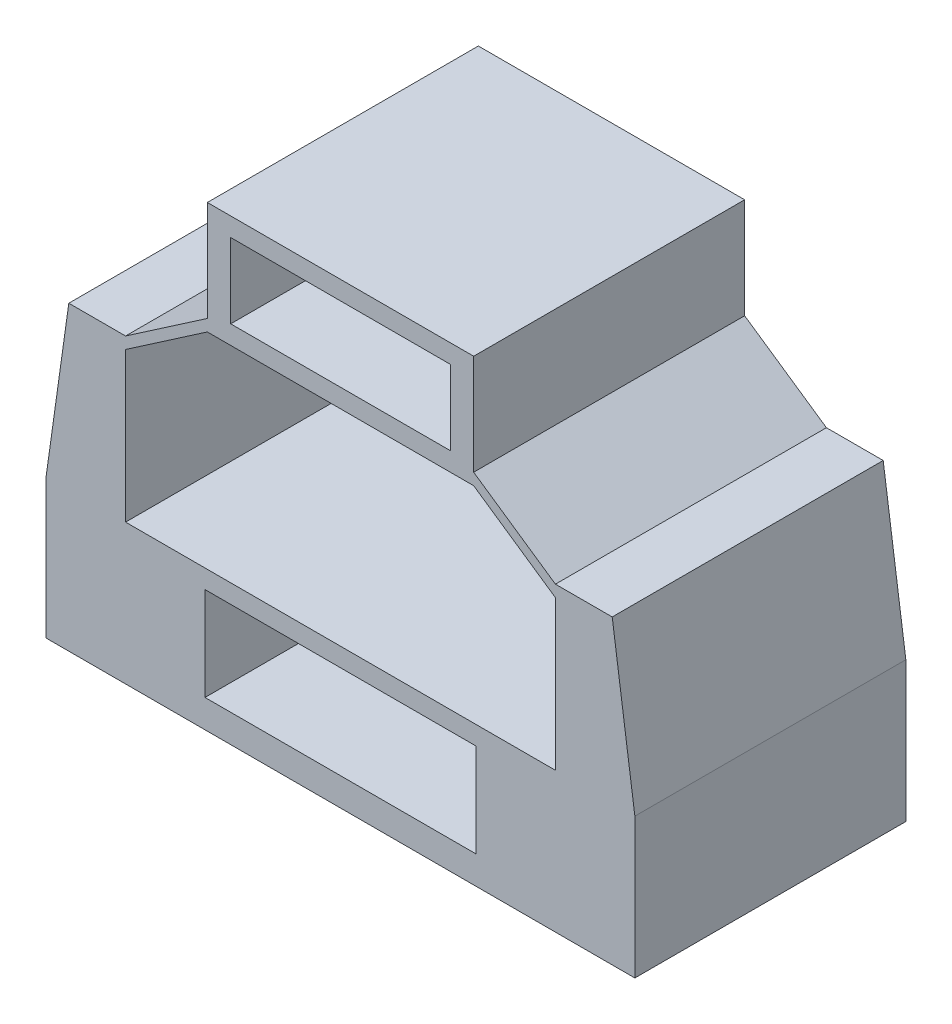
ISO-10303-21;
HEADER;
FILE_DESCRIPTION(('STEP AP214'),'2;1');
FILE_NAME('part.step','',(''),(''),'','','');
FILE_SCHEMA(('AUTOMOTIVE_DESIGN { 1 0 10303 214 1 1 1 1 }'));
ENDSEC;
DATA;
#1=APPLICATION_CONTEXT('core data for automotive mechanical design processes');
#2=APPLICATION_PROTOCOL_DEFINITION('international standard','automotive_design',2000,#1);
#3=PRODUCT_CONTEXT('',#1,'mechanical');
#4=PRODUCT('Part','Part','',(#3));
#5=PRODUCT_RELATED_PRODUCT_CATEGORY('part','',(#4));
#6=PRODUCT_DEFINITION_FORMATION('','',#4);
#7=PRODUCT_DEFINITION_CONTEXT('part definition',#1,'design');
#8=PRODUCT_DEFINITION('design','',#6,#7);
#9=PRODUCT_DEFINITION_SHAPE('','',#8);
#10=(LENGTH_UNIT() NAMED_UNIT(*) SI_UNIT(.MILLI.,.METRE.));
#11=(NAMED_UNIT(*) PLANE_ANGLE_UNIT() SI_UNIT($,.RADIAN.));
#12=(NAMED_UNIT(*) SI_UNIT($,.STERADIAN.) SOLID_ANGLE_UNIT());
#13=UNCERTAINTY_MEASURE_WITH_UNIT(LENGTH_MEASURE(1.E-05),#10,'distance_accuracy_value','');
#14=(GEOMETRIC_REPRESENTATION_CONTEXT(3) GLOBAL_UNCERTAINTY_ASSIGNED_CONTEXT((#13)) GLOBAL_UNIT_ASSIGNED_CONTEXT((#10,
#11,#12)) REPRESENTATION_CONTEXT('',''));
#15=CARTESIAN_POINT('',(0.,0.,0.));
#16=DIRECTION('',(0.,0.,1.));
#17=DIRECTION('',(1.,0.,0.));
#18=AXIS2_PLACEMENT_3D('',#15,#16,#17);
#19=CARTESIAN_POINT('',(0.,0.,5.8));
#20=DIRECTION('',(0.,0.,1.));
#21=DIRECTION('',(1.,0.,0.));
#22=AXIS2_PLACEMENT_3D('',#19,#20,#21);
#23=PLANE('',#22);
#24=DIRECTION('',(0.,1.,0.));
#25=VECTOR('',#24,1.);
#26=CARTESIAN_POINT('',(2.85,9.8,5.8));
#27=LINE('',#26,#25);
#28=CARTESIAN_POINT('',(2.85,7.65,5.8));
#29=VERTEX_POINT('',#28);
#30=CARTESIAN_POINT('',(2.85,9.8,5.8));
#31=VERTEX_POINT('',#30);
#32=EDGE_CURVE('E317',#29,#31,#27,.T.);
#33=ORIENTED_EDGE('',*,*,#32,.T.);
#34=DIRECTION('',(-1.,0.,0.));
#35=VECTOR('',#34,1.);
#36=CARTESIAN_POINT('',(2.85,9.8,5.8));
#37=LINE('',#36,#35);
#38=CARTESIAN_POINT('',(-2.85,9.8,5.8));
#39=VERTEX_POINT('',#38);
#40=EDGE_CURVE('E320',#31,#39,#37,.T.);
#41=ORIENTED_EDGE('',*,*,#40,.T.);
#42=DIRECTION('',(0.,-1.,0.));
#43=VECTOR('',#42,1.);
#44=CARTESIAN_POINT('',(-2.85,9.8,5.8));
#45=LINE('',#44,#43);
#46=CARTESIAN_POINT('',(-2.85,7.65,5.8));
#47=VERTEX_POINT('',#46);
#48=EDGE_CURVE('E323',#39,#47,#45,.T.);
#49=ORIENTED_EDGE('',*,*,#48,.T.);
#50=DIRECTION('',(-0.824728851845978,-0.565528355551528,0.));
#51=VECTOR('',#50,1.);
#52=CARTESIAN_POINT('',(-2.85,7.65,5.8));
#53=LINE('',#52,#51);
#54=CARTESIAN_POINT('',(-4.6,6.45,5.8));
#55=VERTEX_POINT('',#54);
#56=EDGE_CURVE('E325',#47,#55,#53,.T.);
#57=ORIENTED_EDGE('',*,*,#56,.T.);
#58=DIRECTION('',(-1.,0.,0.));
#59=VECTOR('',#58,1.);
#60=CARTESIAN_POINT('',(-4.6,6.45,5.8));
#61=LINE('',#60,#59);
#62=CARTESIAN_POINT('',(-5.8151341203,6.45,5.8));
#63=VERTEX_POINT('',#62);
#64=EDGE_CURVE('E327',#55,#63,#61,.T.);
#65=ORIENTED_EDGE('',*,*,#64,.T.);
#66=DIRECTION('',(-0.139173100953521,-0.99026806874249,0.));
#67=VECTOR('',#66,1.);
#68=CARTESIAN_POINT('',(-5.8151341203,6.45,5.8));
#69=LINE('',#68,#67);
#70=CARTESIAN_POINT('',(-6.3,3.,5.8));
#71=VERTEX_POINT('',#70);
#72=EDGE_CURVE('E329',#63,#71,#69,.T.);
#73=ORIENTED_EDGE('',*,*,#72,.T.);
#74=DIRECTION('',(0.,-1.,0.));
#75=VECTOR('',#74,1.);
#76=CARTESIAN_POINT('',(-6.3,3.,5.8));
#77=LINE('',#76,#75);
#78=CARTESIAN_POINT('',(-6.3,0.,5.8));
#79=VERTEX_POINT('',#78);
#80=EDGE_CURVE('E331',#71,#79,#77,.T.);
#81=ORIENTED_EDGE('',*,*,#80,.T.);
#82=DIRECTION('',(1.,0.,0.));
#83=VECTOR('',#82,1.);
#84=CARTESIAN_POINT('',(-6.3,0.,5.8));
#85=LINE('',#84,#83);
#86=CARTESIAN_POINT('',(6.3,0.,5.8));
#87=VERTEX_POINT('',#86);
#88=EDGE_CURVE('E333',#79,#87,#85,.T.);
#89=ORIENTED_EDGE('',*,*,#88,.T.);
#90=DIRECTION('',(0.,1.,0.));
#91=VECTOR('',#90,1.);
#92=CARTESIAN_POINT('',(6.3,3.,5.8));
#93=LINE('',#92,#91);
#94=CARTESIAN_POINT('',(6.3,3.,5.8));
#95=VERTEX_POINT('',#94);
#96=EDGE_CURVE('E335',#87,#95,#93,.T.);
#97=ORIENTED_EDGE('',*,*,#96,.T.);
#98=DIRECTION('',(-0.139173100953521,0.99026806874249,0.));
#99=VECTOR('',#98,1.);
#100=CARTESIAN_POINT('',(5.8151341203,6.45,5.8));
#101=LINE('',#100,#99);
#102=CARTESIAN_POINT('',(5.8151341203,6.45,5.8));
#103=VERTEX_POINT('',#102);
#104=EDGE_CURVE('E337',#95,#103,#101,.T.);
#105=ORIENTED_EDGE('',*,*,#104,.T.);
#106=DIRECTION('',(-1.,0.,0.));
#107=VECTOR('',#106,1.);
#108=CARTESIAN_POINT('',(4.6,6.45,5.8));
#109=LINE('',#108,#107);
#110=CARTESIAN_POINT('',(4.6,6.45,5.8));
#111=VERTEX_POINT('',#110);
#112=EDGE_CURVE('E339',#103,#111,#109,.T.);
#113=ORIENTED_EDGE('',*,*,#112,.T.);
#114=DIRECTION('',(-0.824728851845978,0.565528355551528,0.));
#115=VECTOR('',#114,1.);
#116=CARTESIAN_POINT('',(2.85,7.65,5.8));
#117=LINE('',#116,#115);
#118=EDGE_CURVE('E341',#111,#29,#117,.T.);
#119=ORIENTED_EDGE('',*,*,#118,.T.);
#120=EDGE_LOOP('',(#33,#41,#49,#57,#65,#73,#81,#89,#97,#105,#113,#119));
#121=FACE_BOUND('',#120,.T.);
#122=DIRECTION('',(0.,1.,0.));
#123=VECTOR('',#122,1.);
#124=CARTESIAN_POINT('',(2.9,0.6,5.8));
#125=LINE('',#124,#123);
#126=CARTESIAN_POINT('',(2.9,0.6,5.8));
#127=VERTEX_POINT('',#126);
#128=CARTESIAN_POINT('',(2.9,2.6,5.8));
#129=VERTEX_POINT('',#128);
#130=EDGE_CURVE('E288',#127,#129,#125,.T.);
#131=ORIENTED_EDGE('',*,*,#130,.F.);
#132=DIRECTION('',(1.,0.,0.));
#133=VECTOR('',#132,1.);
#134=CARTESIAN_POINT('',(2.9,0.6,5.8));
#135=LINE('',#134,#133);
#136=CARTESIAN_POINT('',(-2.9,0.6,5.8));
#137=VERTEX_POINT('',#136);
#138=EDGE_CURVE('E286',#137,#127,#135,.T.);
#139=ORIENTED_EDGE('',*,*,#138,.F.);
#140=DIRECTION('',(0.,-1.,0.));
#141=VECTOR('',#140,1.);
#142=CARTESIAN_POINT('',(-2.9,0.6,5.8));
#143=LINE('',#142,#141);
#144=CARTESIAN_POINT('',(-2.9,2.6,5.8));
#145=VERTEX_POINT('',#144);
#146=EDGE_CURVE('E294',#145,#137,#143,.T.);
#147=ORIENTED_EDGE('',*,*,#146,.F.);
#148=DIRECTION('',(-1.,0.,0.));
#149=VECTOR('',#148,1.);
#150=CARTESIAN_POINT('',(-2.9,2.6,5.8));
#151=LINE('',#150,#149);
#152=EDGE_CURVE('E291',#129,#145,#151,.T.);
#153=ORIENTED_EDGE('',*,*,#152,.F.);
#154=EDGE_LOOP('',(#131,#139,#147,#153));
#155=FACE_BOUND('',#154,.T.);
#156=DIRECTION('',(-0.824728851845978,0.565528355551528,0.));
#157=VECTOR('',#156,1.);
#158=CARTESIAN_POINT('',(4.6,6.2,5.8));
#159=LINE('',#158,#157);
#160=CARTESIAN_POINT('',(4.6,6.2,5.8));
#161=VERTEX_POINT('',#160);
#162=CARTESIAN_POINT('',(2.85,7.4,5.8));
#163=VERTEX_POINT('',#162);
#164=EDGE_CURVE('E243',#161,#163,#159,.T.);
#165=ORIENTED_EDGE('',*,*,#164,.F.);
#166=DIRECTION('',(0.,1.,0.));
#167=VECTOR('',#166,1.);
#168=CARTESIAN_POINT('',(4.6,3.,5.8));
#169=LINE('',#168,#167);
#170=CARTESIAN_POINT('',(4.6,3.,5.8));
#171=VERTEX_POINT('',#170);
#172=EDGE_CURVE('E241',#171,#161,#169,.T.);
#173=ORIENTED_EDGE('',*,*,#172,.F.);
#174=DIRECTION('',(1.,0.,0.));
#175=VECTOR('',#174,1.);
#176=CARTESIAN_POINT('',(4.6,3.,5.8));
#177=LINE('',#176,#175);
#178=CARTESIAN_POINT('',(-4.6,3.,5.8));
#179=VERTEX_POINT('',#178);
#180=EDGE_CURVE('E253',#179,#171,#177,.T.);
#181=ORIENTED_EDGE('',*,*,#180,.F.);
#182=DIRECTION('',(0.,-1.,0.));
#183=VECTOR('',#182,1.);
#184=CARTESIAN_POINT('',(-4.6,3.,5.8));
#185=LINE('',#184,#183);
#186=CARTESIAN_POINT('',(-4.6,6.2,5.8));
#187=VERTEX_POINT('',#186);
#188=EDGE_CURVE('E250',#187,#179,#185,.T.);
#189=ORIENTED_EDGE('',*,*,#188,.F.);
#190=DIRECTION('',(-0.824728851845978,-0.565528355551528,0.));
#191=VECTOR('',#190,1.);
#192=CARTESIAN_POINT('',(-4.6,6.2,5.8));
#193=LINE('',#192,#191);
#194=CARTESIAN_POINT('',(-2.85,7.4,5.8));
#195=VERTEX_POINT('',#194);
#196=EDGE_CURVE('E248',#195,#187,#193,.T.);
#197=ORIENTED_EDGE('',*,*,#196,.F.);
#198=DIRECTION('',(-1.,0.,0.));
#199=VECTOR('',#198,1.);
#200=CARTESIAN_POINT('',(-2.85,7.4,5.8));
#201=LINE('',#200,#199);
#202=EDGE_CURVE('E246',#163,#195,#201,.T.);
#203=ORIENTED_EDGE('',*,*,#202,.F.);
#204=EDGE_LOOP('',(#165,#173,#181,#189,#197,#203));
#205=FACE_BOUND('',#204,.T.);
#206=DIRECTION('',(0.,1.,0.));
#207=VECTOR('',#206,1.);
#208=CARTESIAN_POINT('',(2.35,7.8,5.8));
#209=LINE('',#208,#207);
#210=CARTESIAN_POINT('',(2.35,7.8,5.8));
#211=VERTEX_POINT('',#210);
#212=CARTESIAN_POINT('',(2.35,9.4,5.8));
#213=VERTEX_POINT('',#212);
#214=EDGE_CURVE('E213',#211,#213,#209,.T.);
#215=ORIENTED_EDGE('',*,*,#214,.F.);
#216=DIRECTION('',(1.,0.,0.));
#217=VECTOR('',#216,1.);
#218=CARTESIAN_POINT('',(2.35,7.8,5.8));
#219=LINE('',#218,#217);
#220=CARTESIAN_POINT('',(-2.35,7.8,5.8));
#221=VERTEX_POINT('',#220);
#222=EDGE_CURVE('E205',#221,#211,#219,.T.);
#223=ORIENTED_EDGE('',*,*,#222,.F.);
#224=DIRECTION('',(0.,-1.,0.));
#225=VECTOR('',#224,1.);
#226=CARTESIAN_POINT('',(-2.35,7.8,5.8));
#227=LINE('',#226,#225);
#228=CARTESIAN_POINT('',(-2.35,9.4,5.8));
#229=VERTEX_POINT('',#228);
#230=EDGE_CURVE('E227',#229,#221,#227,.T.);
#231=ORIENTED_EDGE('',*,*,#230,.F.);
#232=DIRECTION('',(-1.,0.,0.));
#233=VECTOR('',#232,1.);
#234=CARTESIAN_POINT('',(-2.35,9.4,5.8));
#235=LINE('',#234,#233);
#236=EDGE_CURVE('E225',#213,#229,#235,.T.);
#237=ORIENTED_EDGE('',*,*,#236,.F.);
#238=EDGE_LOOP('',(#215,#223,#231,#237));
#239=FACE_BOUND('',#238,.T.);
#240=ADVANCED_FACE('F32',(#121,#155,#205,#239),#23,.T.);
#241=CARTESIAN_POINT('',(0.,0.,0.));
#242=DIRECTION('',(0.,0.,1.));
#243=DIRECTION('',(1.,0.,0.));
#244=AXIS2_PLACEMENT_3D('',#241,#242,#243);
#245=PLANE('',#244);
#246=DIRECTION('',(0.,1.,0.));
#247=VECTOR('',#246,1.);
#248=CARTESIAN_POINT('',(4.6,3.,0.));
#249=LINE('',#248,#247);
#250=CARTESIAN_POINT('',(4.6,3.,0.));
#251=VERTEX_POINT('',#250);
#252=CARTESIAN_POINT('',(4.6,6.2,0.));
#253=VERTEX_POINT('',#252);
#254=EDGE_CURVE('E221',#251,#253,#249,.T.);
#255=ORIENTED_EDGE('',*,*,#254,.T.);
#256=DIRECTION('',(-0.824728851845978,0.565528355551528,0.));
#257=VECTOR('',#256,1.);
#258=CARTESIAN_POINT('',(4.6,6.2,0.));
#259=LINE('',#258,#257);
#260=CARTESIAN_POINT('',(2.85,7.4,0.));
#261=VERTEX_POINT('',#260);
#262=EDGE_CURVE('E258',#253,#261,#259,.T.);
#263=ORIENTED_EDGE('',*,*,#262,.T.);
#264=DIRECTION('',(-1.,0.,0.));
#265=VECTOR('',#264,1.);
#266=CARTESIAN_POINT('',(-2.85,7.4,0.));
#267=LINE('',#266,#265);
#268=CARTESIAN_POINT('',(-2.85,7.4,0.));
#269=VERTEX_POINT('',#268);
#270=EDGE_CURVE('E261',#261,#269,#267,.T.);
#271=ORIENTED_EDGE('',*,*,#270,.T.);
#272=DIRECTION('',(-0.824728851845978,-0.565528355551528,0.));
#273=VECTOR('',#272,1.);
#274=CARTESIAN_POINT('',(-4.6,6.2,0.));
#275=LINE('',#274,#273);
#276=CARTESIAN_POINT('',(-4.6,6.2,0.));
#277=VERTEX_POINT('',#276);
#278=EDGE_CURVE('E264',#269,#277,#275,.T.);
#279=ORIENTED_EDGE('',*,*,#278,.T.);
#280=DIRECTION('',(0.,-1.,0.));
#281=VECTOR('',#280,1.);
#282=CARTESIAN_POINT('',(-4.6,3.,0.));
#283=LINE('',#282,#281);
#284=CARTESIAN_POINT('',(-4.6,3.,0.));
#285=VERTEX_POINT('',#284);
#286=EDGE_CURVE('E267',#277,#285,#283,.T.);
#287=ORIENTED_EDGE('',*,*,#286,.T.);
#288=DIRECTION('',(1.,0.,0.));
#289=VECTOR('',#288,1.);
#290=CARTESIAN_POINT('',(4.6,3.,0.));
#291=LINE('',#290,#289);
#292=EDGE_CURVE('E244',#285,#251,#291,.T.);
#293=ORIENTED_EDGE('',*,*,#292,.T.);
#294=EDGE_LOOP('',(#255,#263,#271,#279,#287,#293));
#295=FACE_BOUND('',#294,.T.);
#296=DIRECTION('',(0.,1.,0.));
#297=VECTOR('',#296,1.);
#298=CARTESIAN_POINT('',(2.85,9.8,0.));
#299=LINE('',#298,#297);
#300=CARTESIAN_POINT('',(2.85,7.65,0.));
#301=VERTEX_POINT('',#300);
#302=CARTESIAN_POINT('',(2.85,9.8,0.));
#303=VERTEX_POINT('',#302);
#304=EDGE_CURVE('E316',#301,#303,#299,.T.);
#305=ORIENTED_EDGE('',*,*,#304,.F.);
#306=DIRECTION('',(-0.824728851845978,0.565528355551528,0.));
#307=VECTOR('',#306,1.);
#308=CARTESIAN_POINT('',(2.85,7.65,0.));
#309=LINE('',#308,#307);
#310=CARTESIAN_POINT('',(4.6,6.45,0.));
#311=VERTEX_POINT('',#310);
#312=EDGE_CURVE('E321',#311,#301,#309,.T.);
#313=ORIENTED_EDGE('',*,*,#312,.F.);
#314=DIRECTION('',(-1.,0.,0.));
#315=VECTOR('',#314,1.);
#316=CARTESIAN_POINT('',(4.6,6.45,0.));
#317=LINE('',#316,#315);
#318=CARTESIAN_POINT('',(5.8151341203,6.45,0.));
#319=VERTEX_POINT('',#318);
#320=EDGE_CURVE('E364',#319,#311,#317,.T.);
#321=ORIENTED_EDGE('',*,*,#320,.F.);
#322=DIRECTION('',(-0.139173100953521,0.99026806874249,0.));
#323=VECTOR('',#322,1.);
#324=CARTESIAN_POINT('',(5.8151341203,6.45,0.));
#325=LINE('',#324,#323);
#326=CARTESIAN_POINT('',(6.3,3.,0.));
#327=VERTEX_POINT('',#326);
#328=EDGE_CURVE('E362',#327,#319,#325,.T.);
#329=ORIENTED_EDGE('',*,*,#328,.F.);
#330=DIRECTION('',(0.,1.,0.));
#331=VECTOR('',#330,1.);
#332=CARTESIAN_POINT('',(6.3,3.,0.));
#333=LINE('',#332,#331);
#334=CARTESIAN_POINT('',(6.3,0.,0.));
#335=VERTEX_POINT('',#334);
#336=EDGE_CURVE('E360',#335,#327,#333,.T.);
#337=ORIENTED_EDGE('',*,*,#336,.F.);
#338=DIRECTION('',(1.,0.,0.));
#339=VECTOR('',#338,1.);
#340=CARTESIAN_POINT('',(-6.3,0.,0.));
#341=LINE('',#340,#339);
#342=CARTESIAN_POINT('',(-6.3,0.,0.));
#343=VERTEX_POINT('',#342);
#344=EDGE_CURVE('E358',#343,#335,#341,.T.);
#345=ORIENTED_EDGE('',*,*,#344,.F.);
#346=DIRECTION('',(0.,-1.,0.));
#347=VECTOR('',#346,1.);
#348=CARTESIAN_POINT('',(-6.3,3.,0.));
#349=LINE('',#348,#347);
#350=CARTESIAN_POINT('',(-6.3,3.,0.));
#351=VERTEX_POINT('',#350);
#352=EDGE_CURVE('E356',#351,#343,#349,.T.);
#353=ORIENTED_EDGE('',*,*,#352,.F.);
#354=DIRECTION('',(-0.139173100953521,-0.99026806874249,0.));
#355=VECTOR('',#354,1.);
#356=CARTESIAN_POINT('',(-5.8151341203,6.45,0.));
#357=LINE('',#356,#355);
#358=CARTESIAN_POINT('',(-5.8151341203,6.45,0.));
#359=VERTEX_POINT('',#358);
#360=EDGE_CURVE('E354',#359,#351,#357,.T.);
#361=ORIENTED_EDGE('',*,*,#360,.F.);
#362=DIRECTION('',(-1.,0.,0.));
#363=VECTOR('',#362,1.);
#364=CARTESIAN_POINT('',(-4.6,6.45,0.));
#365=LINE('',#364,#363);
#366=CARTESIAN_POINT('',(-4.6,6.45,0.));
#367=VERTEX_POINT('',#366);
#368=EDGE_CURVE('E352',#367,#359,#365,.T.);
#369=ORIENTED_EDGE('',*,*,#368,.F.);
#370=DIRECTION('',(-0.824728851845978,-0.565528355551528,0.));
#371=VECTOR('',#370,1.);
#372=CARTESIAN_POINT('',(-2.85,7.65,0.));
#373=LINE('',#372,#371);
#374=CARTESIAN_POINT('',(-2.85,7.65,0.));
#375=VERTEX_POINT('',#374);
#376=EDGE_CURVE('E350',#375,#367,#373,.T.);
#377=ORIENTED_EDGE('',*,*,#376,.F.);
#378=DIRECTION('',(0.,-1.,0.));
#379=VECTOR('',#378,1.);
#380=CARTESIAN_POINT('',(-2.85,9.8,0.));
#381=LINE('',#380,#379);
#382=CARTESIAN_POINT('',(-2.85,9.8,0.));
#383=VERTEX_POINT('',#382);
#384=EDGE_CURVE('E348',#383,#375,#381,.T.);
#385=ORIENTED_EDGE('',*,*,#384,.F.);
#386=DIRECTION('',(-1.,0.,0.));
#387=VECTOR('',#386,1.);
#388=CARTESIAN_POINT('',(2.85,9.8,0.));
#389=LINE('',#388,#387);
#390=EDGE_CURVE('E346',#303,#383,#389,.T.);
#391=ORIENTED_EDGE('',*,*,#390,.F.);
#392=EDGE_LOOP('',(#305,#313,#321,#329,#337,#345,#353,#361,#369,#377,#385,#391));
#393=FACE_BOUND('',#392,.T.);
#394=DIRECTION('',(1.,0.,0.));
#395=VECTOR('',#394,1.);
#396=CARTESIAN_POINT('',(2.9,0.6,0.));
#397=LINE('',#396,#395);
#398=CARTESIAN_POINT('',(-2.9,0.6,0.));
#399=VERTEX_POINT('',#398);
#400=CARTESIAN_POINT('',(2.9,0.6,0.));
#401=VERTEX_POINT('',#400);
#402=EDGE_CURVE('E285',#399,#401,#397,.T.);
#403=ORIENTED_EDGE('',*,*,#402,.T.);
#404=DIRECTION('',(0.,1.,0.));
#405=VECTOR('',#404,1.);
#406=CARTESIAN_POINT('',(2.9,0.6,0.));
#407=LINE('',#406,#405);
#408=CARTESIAN_POINT('',(2.9,2.6,0.));
#409=VERTEX_POINT('',#408);
#410=EDGE_CURVE('E299',#401,#409,#407,.T.);
#411=ORIENTED_EDGE('',*,*,#410,.T.);
#412=DIRECTION('',(-1.,0.,0.));
#413=VECTOR('',#412,1.);
#414=CARTESIAN_POINT('',(-2.9,2.6,0.));
#415=LINE('',#414,#413);
#416=CARTESIAN_POINT('',(-2.9,2.6,0.));
#417=VERTEX_POINT('',#416);
#418=EDGE_CURVE('E302',#409,#417,#415,.T.);
#419=ORIENTED_EDGE('',*,*,#418,.T.);
#420=DIRECTION('',(0.,-1.,0.));
#421=VECTOR('',#420,1.);
#422=CARTESIAN_POINT('',(-2.9,0.6,0.));
#423=LINE('',#422,#421);
#424=EDGE_CURVE('E289',#417,#399,#423,.T.);
#425=ORIENTED_EDGE('',*,*,#424,.T.);
#426=EDGE_LOOP('',(#403,#411,#419,#425));
#427=FACE_BOUND('',#426,.T.);
#428=DIRECTION('',(1.,0.,0.));
#429=VECTOR('',#428,1.);
#430=CARTESIAN_POINT('',(2.35,7.8,0.));
#431=LINE('',#430,#429);
#432=CARTESIAN_POINT('',(-2.35,7.8,0.));
#433=VERTEX_POINT('',#432);
#434=CARTESIAN_POINT('',(2.35,7.8,0.));
#435=VERTEX_POINT('',#434);
#436=EDGE_CURVE('E55',#433,#435,#431,.T.);
#437=ORIENTED_EDGE('',*,*,#436,.T.);
#438=DIRECTION('',(0.,1.,0.));
#439=VECTOR('',#438,1.);
#440=CARTESIAN_POINT('',(2.35,7.8,0.));
#441=LINE('',#440,#439);
#442=CARTESIAN_POINT('',(2.35,9.4,0.));
#443=VERTEX_POINT('',#442);
#444=EDGE_CURVE('E220',#435,#443,#441,.T.);
#445=ORIENTED_EDGE('',*,*,#444,.T.);
#446=DIRECTION('',(-1.,0.,0.));
#447=VECTOR('',#446,1.);
#448=CARTESIAN_POINT('',(-2.35,9.4,0.));
#449=LINE('',#448,#447);
#450=CARTESIAN_POINT('',(-2.35,9.4,0.));
#451=VERTEX_POINT('',#450);
#452=EDGE_CURVE('E233',#443,#451,#449,.T.);
#453=ORIENTED_EDGE('',*,*,#452,.T.);
#454=DIRECTION('',(0.,-1.,0.));
#455=VECTOR('',#454,1.);
#456=CARTESIAN_POINT('',(-2.35,7.8,0.));
#457=LINE('',#456,#455);
#458=EDGE_CURVE('E214',#451,#433,#457,.T.);
#459=ORIENTED_EDGE('',*,*,#458,.T.);
#460=EDGE_LOOP('',(#437,#445,#453,#459));
#461=FACE_BOUND('',#460,.T.);
#462=ADVANCED_FACE('F406',(#295,#393,#427,#461),#245,.F.);
#463=CARTESIAN_POINT('',(2.85,9.8,5.8));
#464=DIRECTION('',(-1.,0.,0.));
#465=DIRECTION('',(0.,0.,1.));
#466=AXIS2_PLACEMENT_3D('',#463,#464,#465);
#467=PLANE('',#466);
#468=ORIENTED_EDGE('',*,*,#304,.T.);
#469=DIRECTION('',(0.,0.,-1.));
#470=VECTOR('',#469,1.);
#471=CARTESIAN_POINT('',(2.85,9.8,5.8));
#472=LINE('',#471,#470);
#473=EDGE_CURVE('E11',#31,#303,#472,.T.);
#474=ORIENTED_EDGE('',*,*,#473,.F.);
#475=ORIENTED_EDGE('',*,*,#32,.F.);
#476=DIRECTION('',(0.,0.,-1.));
#477=VECTOR('',#476,1.);
#478=CARTESIAN_POINT('',(2.85,7.65,5.8));
#479=LINE('',#478,#477);
#480=EDGE_CURVE('E343',#29,#301,#479,.T.);
#481=ORIENTED_EDGE('',*,*,#480,.T.);
#482=EDGE_LOOP('',(#468,#474,#475,#481));
#483=FACE_BOUND('',#482,.T.);
#484=ADVANCED_FACE('F34',(#483),#467,.F.);
#485=CARTESIAN_POINT('',(2.85,9.8,5.8));
#486=DIRECTION('',(0.,-1.,0.));
#487=DIRECTION('',(0.,0.,-1.));
#488=AXIS2_PLACEMENT_3D('',#485,#486,#487);
#489=PLANE('',#488);
#490=ORIENTED_EDGE('',*,*,#390,.T.);
#491=DIRECTION('',(0.,0.,-1.));
#492=VECTOR('',#491,1.);
#493=CARTESIAN_POINT('',(-2.85,9.8,5.8));
#494=LINE('',#493,#492);
#495=EDGE_CURVE('E40',#39,#383,#494,.T.);
#496=ORIENTED_EDGE('',*,*,#495,.F.);
#497=ORIENTED_EDGE('',*,*,#40,.F.);
#498=ORIENTED_EDGE('',*,*,#473,.T.);
#499=EDGE_LOOP('',(#490,#496,#497,#498));
#500=FACE_BOUND('',#499,.T.);
#501=ADVANCED_FACE('F424',(#500),#489,.F.);
#502=CARTESIAN_POINT('',(-2.85,9.8,5.8));
#503=DIRECTION('',(1.,0.,0.));
#504=DIRECTION('',(0.,0.,-1.));
#505=AXIS2_PLACEMENT_3D('',#502,#503,#504);
#506=PLANE('',#505);
#507=ORIENTED_EDGE('',*,*,#384,.T.);
#508=DIRECTION('',(0.,0.,-1.));
#509=VECTOR('',#508,1.);
#510=CARTESIAN_POINT('',(-2.85,7.65,5.8));
#511=LINE('',#510,#509);
#512=EDGE_CURVE('E393',#47,#375,#511,.T.);
#513=ORIENTED_EDGE('',*,*,#512,.F.);
#514=ORIENTED_EDGE('',*,*,#48,.F.);
#515=ORIENTED_EDGE('',*,*,#495,.T.);
#516=EDGE_LOOP('',(#507,#513,#514,#515));
#517=FACE_BOUND('',#516,.T.);
#518=ADVANCED_FACE('F400',(#517),#506,.F.);
#519=CARTESIAN_POINT('',(-2.85,7.65,5.8));
#520=DIRECTION('',(0.565528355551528,-0.824728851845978,0.));
#521=DIRECTION('',(0.824728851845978,0.565528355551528,0.));
#522=AXIS2_PLACEMENT_3D('',#519,#520,#521);
#523=PLANE('',#522);
#524=ORIENTED_EDGE('',*,*,#376,.T.);
#525=DIRECTION('',(0.,0.,-1.));
#526=VECTOR('',#525,1.);
#527=CARTESIAN_POINT('',(-4.6,6.45,5.8));
#528=LINE('',#527,#526);
#529=EDGE_CURVE('E390',#55,#367,#528,.T.);
#530=ORIENTED_EDGE('',*,*,#529,.F.);
#531=ORIENTED_EDGE('',*,*,#56,.F.);
#532=ORIENTED_EDGE('',*,*,#512,.T.);
#533=EDGE_LOOP('',(#524,#530,#531,#532));
#534=FACE_BOUND('',#533,.T.);
#535=ADVANCED_FACE('F412',(#534),#523,.F.);
#536=CARTESIAN_POINT('',(-4.6,6.45,5.8));
#537=DIRECTION('',(0.,-1.,0.));
#538=DIRECTION('',(0.,0.,-1.));
#539=AXIS2_PLACEMENT_3D('',#536,#537,#538);
#540=PLANE('',#539);
#541=ORIENTED_EDGE('',*,*,#368,.T.);
#542=DIRECTION('',(0.,0.,-1.));
#543=VECTOR('',#542,1.);
#544=CARTESIAN_POINT('',(-5.8151341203,6.45,5.8));
#545=LINE('',#544,#543);
#546=EDGE_CURVE('E387',#63,#359,#545,.T.);
#547=ORIENTED_EDGE('',*,*,#546,.F.);
#548=ORIENTED_EDGE('',*,*,#64,.F.);
#549=ORIENTED_EDGE('',*,*,#529,.T.);
#550=EDGE_LOOP('',(#541,#547,#548,#549));
#551=FACE_BOUND('',#550,.T.);
#552=ADVANCED_FACE('F416',(#551),#540,.F.);
#553=CARTESIAN_POINT('',(-5.8151341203,6.45,5.8));
#554=DIRECTION('',(0.99026806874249,-0.139173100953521,0.));
#555=DIRECTION('',(0.139173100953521,0.99026806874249,0.));
#556=AXIS2_PLACEMENT_3D('',#553,#554,#555);
#557=PLANE('',#556);
#558=ORIENTED_EDGE('',*,*,#360,.T.);
#559=DIRECTION('',(0.,0.,-1.));
#560=VECTOR('',#559,1.);
#561=CARTESIAN_POINT('',(-6.3,3.,5.8));
#562=LINE('',#561,#560);
#563=EDGE_CURVE('E384',#71,#351,#562,.T.);
#564=ORIENTED_EDGE('',*,*,#563,.F.);
#565=ORIENTED_EDGE('',*,*,#72,.F.);
#566=ORIENTED_EDGE('',*,*,#546,.T.);
#567=EDGE_LOOP('',(#558,#564,#565,#566));
#568=FACE_BOUND('',#567,.T.);
#569=ADVANCED_FACE('F457',(#568),#557,.F.);
#570=CARTESIAN_POINT('',(-6.3,3.,5.8));
#571=DIRECTION('',(1.,0.,0.));
#572=DIRECTION('',(0.,0.,-1.));
#573=AXIS2_PLACEMENT_3D('',#570,#571,#572);
#574=PLANE('',#573);
#575=ORIENTED_EDGE('',*,*,#352,.T.);
#576=DIRECTION('',(0.,0.,-1.));
#577=VECTOR('',#576,1.);
#578=CARTESIAN_POINT('',(-6.3,0.,5.8));
#579=LINE('',#578,#577);
#580=EDGE_CURVE('E381',#79,#343,#579,.T.);
#581=ORIENTED_EDGE('',*,*,#580,.F.);
#582=ORIENTED_EDGE('',*,*,#80,.F.);
#583=ORIENTED_EDGE('',*,*,#563,.T.);
#584=EDGE_LOOP('',(#575,#581,#582,#583));
#585=FACE_BOUND('',#584,.T.);
#586=ADVANCED_FACE('F455',(#585),#574,.F.);
#587=CARTESIAN_POINT('',(-6.3,0.,5.8));
#588=DIRECTION('',(0.,1.,0.));
#589=DIRECTION('',(0.,0.,1.));
#590=AXIS2_PLACEMENT_3D('',#587,#588,#589);
#591=PLANE('',#590);
#592=ORIENTED_EDGE('',*,*,#344,.T.);
#593=DIRECTION('',(0.,0.,-1.));
#594=VECTOR('',#593,1.);
#595=CARTESIAN_POINT('',(6.3,0.,5.8));
#596=LINE('',#595,#594);
#597=EDGE_CURVE('E378',#87,#335,#596,.T.);
#598=ORIENTED_EDGE('',*,*,#597,.F.);
#599=ORIENTED_EDGE('',*,*,#88,.F.);
#600=ORIENTED_EDGE('',*,*,#580,.T.);
#601=EDGE_LOOP('',(#592,#598,#599,#600));
#602=FACE_BOUND('',#601,.T.);
#603=ADVANCED_FACE('F451',(#602),#591,.F.);
#604=CARTESIAN_POINT('',(6.3,3.,5.8));
#605=DIRECTION('',(-1.,0.,0.));
#606=DIRECTION('',(0.,0.,1.));
#607=AXIS2_PLACEMENT_3D('',#604,#605,#606);
#608=PLANE('',#607);
#609=ORIENTED_EDGE('',*,*,#336,.T.);
#610=DIRECTION('',(0.,0.,-1.));
#611=VECTOR('',#610,1.);
#612=CARTESIAN_POINT('',(6.3,3.,5.8));
#613=LINE('',#612,#611);
#614=EDGE_CURVE('E375',#95,#327,#613,.T.);
#615=ORIENTED_EDGE('',*,*,#614,.F.);
#616=ORIENTED_EDGE('',*,*,#96,.F.);
#617=ORIENTED_EDGE('',*,*,#597,.T.);
#618=EDGE_LOOP('',(#609,#615,#616,#617));
#619=FACE_BOUND('',#618,.T.);
#620=ADVANCED_FACE('F446',(#619),#608,.F.);
#621=CARTESIAN_POINT('',(5.8151341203,6.45,5.8));
#622=DIRECTION('',(-0.99026806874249,-0.139173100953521,0.));
#623=DIRECTION('',(0.139173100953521,-0.99026806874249,0.));
#624=AXIS2_PLACEMENT_3D('',#621,#622,#623);
#625=PLANE('',#624);
#626=ORIENTED_EDGE('',*,*,#328,.T.);
#627=DIRECTION('',(0.,0.,-1.));
#628=VECTOR('',#627,1.);
#629=CARTESIAN_POINT('',(5.8151341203,6.45,5.8));
#630=LINE('',#629,#628);
#631=EDGE_CURVE('E372',#103,#319,#630,.T.);
#632=ORIENTED_EDGE('',*,*,#631,.F.);
#633=ORIENTED_EDGE('',*,*,#104,.F.);
#634=ORIENTED_EDGE('',*,*,#614,.T.);
#635=EDGE_LOOP('',(#626,#632,#633,#634));
#636=FACE_BOUND('',#635,.T.);
#637=ADVANCED_FACE('F440',(#636),#625,.F.);
#638=CARTESIAN_POINT('',(4.6,6.45,5.8));
#639=DIRECTION('',(0.,-1.,0.));
#640=DIRECTION('',(0.,0.,-1.));
#641=AXIS2_PLACEMENT_3D('',#638,#639,#640);
#642=PLANE('',#641);
#643=ORIENTED_EDGE('',*,*,#320,.T.);
#644=DIRECTION('',(0.,0.,-1.));
#645=VECTOR('',#644,1.);
#646=CARTESIAN_POINT('',(4.6,6.45,5.8));
#647=LINE('',#646,#645);
#648=EDGE_CURVE('E369',#111,#311,#647,.T.);
#649=ORIENTED_EDGE('',*,*,#648,.F.);
#650=ORIENTED_EDGE('',*,*,#112,.F.);
#651=ORIENTED_EDGE('',*,*,#631,.T.);
#652=EDGE_LOOP('',(#643,#649,#650,#651));
#653=FACE_BOUND('',#652,.T.);
#654=ADVANCED_FACE('F436',(#653),#642,.F.);
#655=CARTESIAN_POINT('',(2.85,7.65,5.8));
#656=DIRECTION('',(-0.565528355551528,-0.824728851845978,0.));
#657=DIRECTION('',(0.824728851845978,-0.565528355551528,0.));
#658=AXIS2_PLACEMENT_3D('',#655,#656,#657);
#659=PLANE('',#658);
#660=ORIENTED_EDGE('',*,*,#312,.T.);
#661=ORIENTED_EDGE('',*,*,#480,.F.);
#662=ORIENTED_EDGE('',*,*,#118,.F.);
#663=ORIENTED_EDGE('',*,*,#648,.T.);
#664=EDGE_LOOP('',(#660,#661,#662,#663));
#665=FACE_BOUND('',#664,.T.);
#666=ADVANCED_FACE('F431',(#665),#659,.F.);
#667=CARTESIAN_POINT('',(2.9,0.6,5.8));
#668=DIRECTION('',(0.,1.,0.));
#669=DIRECTION('',(0.,0.,1.));
#670=AXIS2_PLACEMENT_3D('',#667,#668,#669);
#671=PLANE('',#670);
#672=ORIENTED_EDGE('',*,*,#402,.F.);
#673=DIRECTION('',(0.,0.,-1.));
#674=VECTOR('',#673,1.);
#675=CARTESIAN_POINT('',(-2.9,0.6,5.8));
#676=LINE('',#675,#674);
#677=EDGE_CURVE('E296',#137,#399,#676,.T.);
#678=ORIENTED_EDGE('',*,*,#677,.F.);
#679=ORIENTED_EDGE('',*,*,#138,.T.);
#680=DIRECTION('',(0.,0.,-1.));
#681=VECTOR('',#680,1.);
#682=CARTESIAN_POINT('',(2.9,0.6,5.8));
#683=LINE('',#682,#681);
#684=EDGE_CURVE('E313',#127,#401,#683,.T.);
#685=ORIENTED_EDGE('',*,*,#684,.T.);
#686=EDGE_LOOP('',(#672,#678,#679,#685));
#687=FACE_BOUND('',#686,.T.);
#688=ADVANCED_FACE('F474',(#687),#671,.T.);
#689=CARTESIAN_POINT('',(2.9,0.6,5.8));
#690=DIRECTION('',(-1.,0.,0.));
#691=DIRECTION('',(0.,0.,1.));
#692=AXIS2_PLACEMENT_3D('',#689,#690,#691);
#693=PLANE('',#692);
#694=ORIENTED_EDGE('',*,*,#410,.F.);
#695=ORIENTED_EDGE('',*,*,#684,.F.);
#696=ORIENTED_EDGE('',*,*,#130,.T.);
#697=DIRECTION('',(0.,0.,-1.));
#698=VECTOR('',#697,1.);
#699=CARTESIAN_POINT('',(2.9,2.6,5.8));
#700=LINE('',#699,#698);
#701=EDGE_CURVE('E311',#129,#409,#700,.T.);
#702=ORIENTED_EDGE('',*,*,#701,.T.);
#703=EDGE_LOOP('',(#694,#695,#696,#702));
#704=FACE_BOUND('',#703,.T.);
#705=ADVANCED_FACE('F512',(#704),#693,.T.);
#706=CARTESIAN_POINT('',(-2.9,2.6,5.8));
#707=DIRECTION('',(0.,-1.,0.));
#708=DIRECTION('',(0.,0.,-1.));
#709=AXIS2_PLACEMENT_3D('',#706,#707,#708);
#710=PLANE('',#709);
#711=ORIENTED_EDGE('',*,*,#418,.F.);
#712=ORIENTED_EDGE('',*,*,#701,.F.);
#713=ORIENTED_EDGE('',*,*,#152,.T.);
#714=DIRECTION('',(0.,0.,-1.));
#715=VECTOR('',#714,1.);
#716=CARTESIAN_POINT('',(-2.9,2.6,5.8));
#717=LINE('',#716,#715);
#718=EDGE_CURVE('E309',#145,#417,#717,.T.);
#719=ORIENTED_EDGE('',*,*,#718,.T.);
#720=EDGE_LOOP('',(#711,#712,#713,#719));
#721=FACE_BOUND('',#720,.T.);
#722=ADVANCED_FACE('F519',(#721),#710,.T.);
#723=CARTESIAN_POINT('',(-2.9,0.6,5.8));
#724=DIRECTION('',(1.,0.,0.));
#725=DIRECTION('',(0.,0.,-1.));
#726=AXIS2_PLACEMENT_3D('',#723,#724,#725);
#727=PLANE('',#726);
#728=ORIENTED_EDGE('',*,*,#424,.F.);
#729=ORIENTED_EDGE('',*,*,#718,.F.);
#730=ORIENTED_EDGE('',*,*,#146,.T.);
#731=ORIENTED_EDGE('',*,*,#677,.T.);
#732=EDGE_LOOP('',(#728,#729,#730,#731));
#733=FACE_BOUND('',#732,.T.);
#734=ADVANCED_FACE('F526',(#733),#727,.T.);
#735=CARTESIAN_POINT('',(4.6,3.,5.8));
#736=DIRECTION('',(-1.,0.,0.));
#737=DIRECTION('',(0.,0.,1.));
#738=AXIS2_PLACEMENT_3D('',#735,#736,#737);
#739=PLANE('',#738);
#740=ORIENTED_EDGE('',*,*,#254,.F.);
#741=DIRECTION('',(0.,0.,-1.));
#742=VECTOR('',#741,1.);
#743=CARTESIAN_POINT('',(4.6,3.,5.8));
#744=LINE('',#743,#742);
#745=EDGE_CURVE('E255',#171,#251,#744,.T.);
#746=ORIENTED_EDGE('',*,*,#745,.F.);
#747=ORIENTED_EDGE('',*,*,#172,.T.);
#748=DIRECTION('',(0.,0.,-1.));
#749=VECTOR('',#748,1.);
#750=CARTESIAN_POINT('',(4.6,6.2,5.8));
#751=LINE('',#750,#749);
#752=EDGE_CURVE('E282',#161,#253,#751,.T.);
#753=ORIENTED_EDGE('',*,*,#752,.T.);
#754=EDGE_LOOP('',(#740,#746,#747,#753));
#755=FACE_BOUND('',#754,.T.);
#756=ADVANCED_FACE('F534',(#755),#739,.T.);
#757=CARTESIAN_POINT('',(4.6,6.2,5.8));
#758=DIRECTION('',(-0.565528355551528,-0.824728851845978,0.));
#759=DIRECTION('',(0.824728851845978,-0.565528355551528,0.));
#760=AXIS2_PLACEMENT_3D('',#757,#758,#759);
#761=PLANE('',#760);
#762=ORIENTED_EDGE('',*,*,#262,.F.);
#763=ORIENTED_EDGE('',*,*,#752,.F.);
#764=ORIENTED_EDGE('',*,*,#164,.T.);
#765=DIRECTION('',(0.,0.,-1.));
#766=VECTOR('',#765,1.);
#767=CARTESIAN_POINT('',(2.85,7.4,5.8));
#768=LINE('',#767,#766);
#769=EDGE_CURVE('E280',#163,#261,#768,.T.);
#770=ORIENTED_EDGE('',*,*,#769,.T.);
#771=EDGE_LOOP('',(#762,#763,#764,#770));
#772=FACE_BOUND('',#771,.T.);
#773=ADVANCED_FACE('F542',(#772),#761,.T.);
#774=CARTESIAN_POINT('',(-2.85,7.4,5.8));
#775=DIRECTION('',(0.,-1.,0.));
#776=DIRECTION('',(0.,0.,-1.));
#777=AXIS2_PLACEMENT_3D('',#774,#775,#776);
#778=PLANE('',#777);
#779=ORIENTED_EDGE('',*,*,#270,.F.);
#780=ORIENTED_EDGE('',*,*,#769,.F.);
#781=ORIENTED_EDGE('',*,*,#202,.T.);
#782=DIRECTION('',(0.,0.,-1.));
#783=VECTOR('',#782,1.);
#784=CARTESIAN_POINT('',(-2.85,7.4,5.8));
#785=LINE('',#784,#783);
#786=EDGE_CURVE('E278',#195,#269,#785,.T.);
#787=ORIENTED_EDGE('',*,*,#786,.T.);
#788=EDGE_LOOP('',(#779,#780,#781,#787));
#789=FACE_BOUND('',#788,.T.);
#790=ADVANCED_FACE('F550',(#789),#778,.T.);
#791=CARTESIAN_POINT('',(-4.6,6.2,5.8));
#792=DIRECTION('',(0.565528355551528,-0.824728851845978,0.));
#793=DIRECTION('',(0.824728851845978,0.565528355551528,0.));
#794=AXIS2_PLACEMENT_3D('',#791,#792,#793);
#795=PLANE('',#794);
#796=ORIENTED_EDGE('',*,*,#278,.F.);
#797=ORIENTED_EDGE('',*,*,#786,.F.);
#798=ORIENTED_EDGE('',*,*,#196,.T.);
#799=DIRECTION('',(0.,0.,-1.));
#800=VECTOR('',#799,1.);
#801=CARTESIAN_POINT('',(-4.6,6.2,5.8));
#802=LINE('',#801,#800);
#803=EDGE_CURVE('E276',#187,#277,#802,.T.);
#804=ORIENTED_EDGE('',*,*,#803,.T.);
#805=EDGE_LOOP('',(#796,#797,#798,#804));
#806=FACE_BOUND('',#805,.T.);
#807=ADVANCED_FACE('F558',(#806),#795,.T.);
#808=CARTESIAN_POINT('',(-4.6,3.,5.8));
#809=DIRECTION('',(1.,0.,0.));
#810=DIRECTION('',(0.,0.,-1.));
#811=AXIS2_PLACEMENT_3D('',#808,#809,#810);
#812=PLANE('',#811);
#813=ORIENTED_EDGE('',*,*,#286,.F.);
#814=ORIENTED_EDGE('',*,*,#803,.F.);
#815=ORIENTED_EDGE('',*,*,#188,.T.);
#816=DIRECTION('',(0.,0.,-1.));
#817=VECTOR('',#816,1.);
#818=CARTESIAN_POINT('',(-4.6,3.,5.8));
#819=LINE('',#818,#817);
#820=EDGE_CURVE('E274',#179,#285,#819,.T.);
#821=ORIENTED_EDGE('',*,*,#820,.T.);
#822=EDGE_LOOP('',(#813,#814,#815,#821));
#823=FACE_BOUND('',#822,.T.);
#824=ADVANCED_FACE('F566',(#823),#812,.T.);
#825=CARTESIAN_POINT('',(4.6,3.,5.8));
#826=DIRECTION('',(0.,1.,0.));
#827=DIRECTION('',(0.,0.,1.));
#828=AXIS2_PLACEMENT_3D('',#825,#826,#827);
#829=PLANE('',#828);
#830=ORIENTED_EDGE('',*,*,#292,.F.);
#831=ORIENTED_EDGE('',*,*,#820,.F.);
#832=ORIENTED_EDGE('',*,*,#180,.T.);
#833=ORIENTED_EDGE('',*,*,#745,.T.);
#834=EDGE_LOOP('',(#830,#831,#832,#833));
#835=FACE_BOUND('',#834,.T.);
#836=ADVANCED_FACE('F574',(#835),#829,.T.);
#837=CARTESIAN_POINT('',(2.35,7.8,5.8));
#838=DIRECTION('',(0.,1.,0.));
#839=DIRECTION('',(0.,0.,1.));
#840=AXIS2_PLACEMENT_3D('',#837,#838,#839);
#841=PLANE('',#840);
#842=ORIENTED_EDGE('',*,*,#436,.F.);
#843=DIRECTION('',(0.,0.,-1.));
#844=VECTOR('',#843,1.);
#845=CARTESIAN_POINT('',(-2.35,7.8,5.8));
#846=LINE('',#845,#844);
#847=EDGE_CURVE('E209',#221,#433,#846,.T.);
#848=ORIENTED_EDGE('',*,*,#847,.F.);
#849=ORIENTED_EDGE('',*,*,#222,.T.);
#850=DIRECTION('',(0.,0.,-1.));
#851=VECTOR('',#850,1.);
#852=CARTESIAN_POINT('',(2.35,7.8,5.8));
#853=LINE('',#852,#851);
#854=EDGE_CURVE('E208',#211,#435,#853,.T.);
#855=ORIENTED_EDGE('',*,*,#854,.T.);
#856=EDGE_LOOP('',(#842,#848,#849,#855));
#857=FACE_BOUND('',#856,.T.);
#858=ADVANCED_FACE('F207',(#857),#841,.T.);
#859=CARTESIAN_POINT('',(2.35,7.8,5.8));
#860=DIRECTION('',(-1.,0.,0.));
#861=DIRECTION('',(0.,0.,1.));
#862=AXIS2_PLACEMENT_3D('',#859,#860,#861);
#863=PLANE('',#862);
#864=ORIENTED_EDGE('',*,*,#444,.F.);
#865=ORIENTED_EDGE('',*,*,#854,.F.);
#866=ORIENTED_EDGE('',*,*,#214,.T.);
#867=DIRECTION('',(0.,0.,-1.));
#868=VECTOR('',#867,1.);
#869=CARTESIAN_POINT('',(2.35,9.4,5.8));
#870=LINE('',#869,#868);
#871=EDGE_CURVE('E222',#213,#443,#870,.T.);
#872=ORIENTED_EDGE('',*,*,#871,.T.);
#873=EDGE_LOOP('',(#864,#865,#866,#872));
#874=FACE_BOUND('',#873,.T.);
#875=ADVANCED_FACE('F217',(#874),#863,.T.);
#876=CARTESIAN_POINT('',(-2.35,9.4,5.8));
#877=DIRECTION('',(0.,-1.,0.));
#878=DIRECTION('',(0.,0.,-1.));
#879=AXIS2_PLACEMENT_3D('',#876,#877,#878);
#880=PLANE('',#879);
#881=ORIENTED_EDGE('',*,*,#452,.F.);
#882=ORIENTED_EDGE('',*,*,#871,.F.);
#883=ORIENTED_EDGE('',*,*,#236,.T.);
#884=DIRECTION('',(0.,0.,-1.));
#885=VECTOR('',#884,1.);
#886=CARTESIAN_POINT('',(-2.35,9.4,5.8));
#887=LINE('',#886,#885);
#888=EDGE_CURVE('E47',#229,#451,#887,.T.);
#889=ORIENTED_EDGE('',*,*,#888,.T.);
#890=EDGE_LOOP('',(#881,#882,#883,#889));
#891=FACE_BOUND('',#890,.T.);
#892=ADVANCED_FACE('F595',(#891),#880,.T.);
#893=CARTESIAN_POINT('',(-2.35,7.8,5.8));
#894=DIRECTION('',(1.,0.,0.));
#895=DIRECTION('',(0.,0.,-1.));
#896=AXIS2_PLACEMENT_3D('',#893,#894,#895);
#897=PLANE('',#896);
#898=ORIENTED_EDGE('',*,*,#458,.F.);
#899=ORIENTED_EDGE('',*,*,#888,.F.);
#900=ORIENTED_EDGE('',*,*,#230,.T.);
#901=ORIENTED_EDGE('',*,*,#847,.T.);
#902=EDGE_LOOP('',(#898,#899,#900,#901));
#903=FACE_BOUND('',#902,.T.);
#904=ADVANCED_FACE('F602',(#903),#897,.T.);
#905=CLOSED_SHELL('',(#240,#462,#484,#501,#518,#535,#552,#569,#586,#603,#620,#637,#654,#666,
#688,#705,#722,#734,#756,#773,#790,#807,#824,#836,#858,#875,#892,#904));
#906=MANIFOLD_SOLID_BREP('B2',#905);
#907=ADVANCED_BREP_SHAPE_REPRESENTATION('',(#18,#906),#14);
#908=SHAPE_DEFINITION_REPRESENTATION(#9,#907);
ENDSEC;
END-ISO-10303-21;
